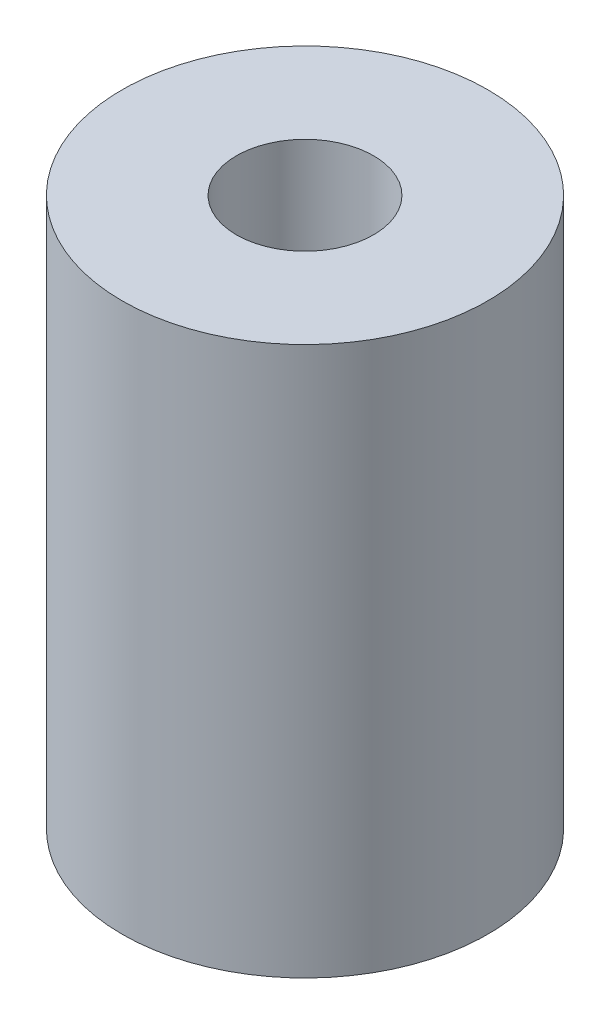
from build123d import *

# Parameters (mm, degrees)
SKETCH1_R      = 12.7
EXTRUDE1_DEPTH = 38.1
SKETCH3_R      = 3.175
EXTRUDE3_DEPTH = 17.018
SKETCH5_R      = 4.7625
EXTRUDE4_DEPTH = 17.018


with BuildPart() as part:
    # Sketch1 → Extrude1 (new body)
    with BuildSketch(Plane(origin=(0, 0, 0), x_dir=(1, 0, 0), z_dir=(0, 1, 0))):
        with Locations(Location((0, 0, 0), (0, 0, 270))):
            Circle(SKETCH1_R)
    extrude(amount=-EXTRUDE1_DEPTH)

    # Sketch3 → Extrude3 (cut)
    with BuildSketch(Plane.XZ.offset(38.1)):
        with Locations(Location((0, 0, 0), (0, 0, 270))):
            Circle(SKETCH3_R)
    extrude(amount=-EXTRUDE3_DEPTH, mode=Mode.SUBTRACT)

    # Sketch5 → Extrude4 (cut)
    with BuildSketch(Plane(origin=(0, 0, 0), x_dir=(-1, 0, 0), z_dir=(0, 1, 0))):
        with Locations(Location((0, 0, 0), (0, 0, 90))):
            Circle(SKETCH5_R)
    extrude(amount=-EXTRUDE4_DEPTH, mode=Mode.SUBTRACT)


solid = part.part
